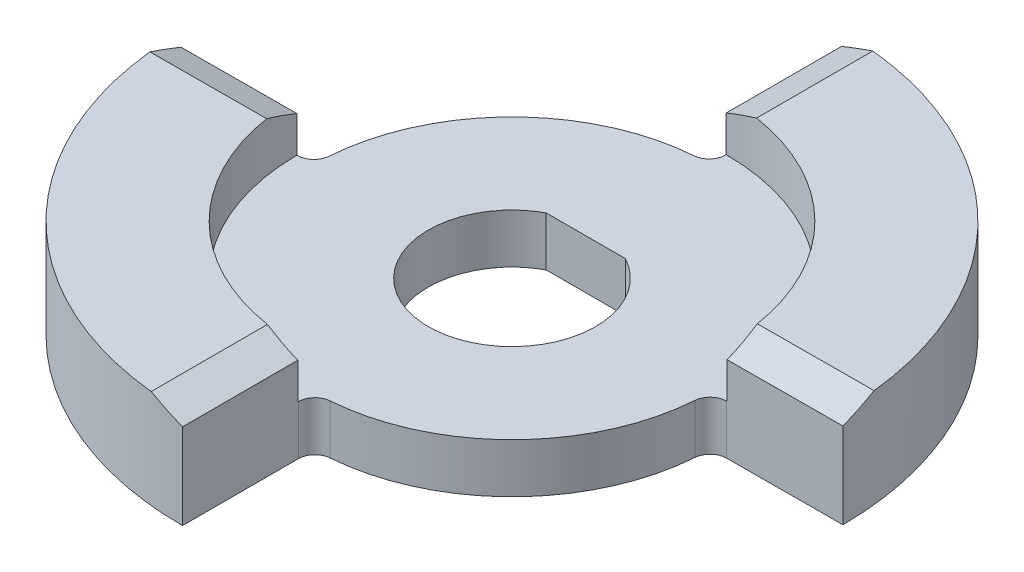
ISO-10303-21;
HEADER;
FILE_DESCRIPTION(('STEP AP214'),'2;1');
FILE_NAME('part.step','',(''),(''),'','','');
FILE_SCHEMA(('AUTOMOTIVE_DESIGN { 1 0 10303 214 1 1 1 1 }'));
ENDSEC;
DATA;
#1=APPLICATION_CONTEXT('core data for automotive mechanical design processes');
#2=APPLICATION_PROTOCOL_DEFINITION('international standard','automotive_design',2000,#1);
#3=PRODUCT_CONTEXT('',#1,'mechanical');
#4=PRODUCT('Part','Part','',(#3));
#5=PRODUCT_RELATED_PRODUCT_CATEGORY('part','',(#4));
#6=PRODUCT_DEFINITION_FORMATION('','',#4);
#7=PRODUCT_DEFINITION_CONTEXT('part definition',#1,'design');
#8=PRODUCT_DEFINITION('design','',#6,#7);
#9=PRODUCT_DEFINITION_SHAPE('','',#8);
#10=(LENGTH_UNIT() NAMED_UNIT(*) SI_UNIT(.MILLI.,.METRE.));
#11=(NAMED_UNIT(*) PLANE_ANGLE_UNIT() SI_UNIT($,.RADIAN.));
#12=(NAMED_UNIT(*) SI_UNIT($,.STERADIAN.) SOLID_ANGLE_UNIT());
#13=UNCERTAINTY_MEASURE_WITH_UNIT(LENGTH_MEASURE(1.E-05),#10,'distance_accuracy_value','');
#14=(GEOMETRIC_REPRESENTATION_CONTEXT(3) GLOBAL_UNCERTAINTY_ASSIGNED_CONTEXT((#13)) GLOBAL_UNIT_ASSIGNED_CONTEXT((#10,
#11,#12)) REPRESENTATION_CONTEXT('',''));
#15=CARTESIAN_POINT('',(0.,0.,0.));
#16=DIRECTION('',(0.,0.,1.));
#17=DIRECTION('',(1.,0.,0.));
#18=AXIS2_PLACEMENT_3D('',#15,#16,#17);
#19=CARTESIAN_POINT('',(0.,0.,0.));
#20=DIRECTION('',(0.,1.,0.));
#21=DIRECTION('',(0.,0.,1.));
#22=AXIS2_PLACEMENT_3D('',#19,#20,#21);
#23=CYLINDRICAL_SURFACE('',#22,19.05);
#24=DIRECTION('',(0.,1.,0.));
#25=VECTOR('',#24,1.);
#26=CARTESIAN_POINT('',(18.9997685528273,0.,1.3824959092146));
#27=LINE('',#26,#25);
#28=CARTESIAN_POINT('',(18.9997685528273,3.175,1.3824959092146));
#29=VERTEX_POINT('',#28);
#30=CARTESIAN_POINT('',(18.9997685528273,7.9375,1.3824959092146));
#31=VERTEX_POINT('',#30);
#32=EDGE_CURVE('E314',#29,#31,#27,.T.);
#33=ORIENTED_EDGE('',*,*,#32,.T.);
#34=CARTESIAN_POINT('',(0.,7.9375,0.));
#35=DIRECTION('',(0.,1.,0.));
#36=DIRECTION('',(0.,0.,1.));
#37=AXIS2_PLACEMENT_3D('',#34,#35,#36);
#38=CIRCLE('',#37,19.05);
#39=CARTESIAN_POINT('',(1.46538461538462,7.9375,18.9935554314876));
#40=VERTEX_POINT('',#39);
#41=EDGE_CURVE('E363',#31,#40,#38,.F.);
#42=ORIENTED_EDGE('',*,*,#41,.T.);
#43=DIRECTION('',(0.,1.,0.));
#44=VECTOR('',#43,1.);
#45=CARTESIAN_POINT('',(1.46538461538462,0.,18.9935554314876));
#46=LINE('',#45,#44);
#47=CARTESIAN_POINT('',(1.46538461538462,3.175,18.9935554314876));
#48=VERTEX_POINT('',#47);
#49=EDGE_CURVE('E317',#40,#48,#46,.F.);
#50=ORIENTED_EDGE('',*,*,#49,.T.);
#51=CARTESIAN_POINT('',(0.,3.175,0.));
#52=DIRECTION('',(0.,-1.,0.));
#53=DIRECTION('',(0.,0.,-1.));
#54=AXIS2_PLACEMENT_3D('',#51,#52,#53);
#55=CIRCLE('',#54,19.05);
#56=EDGE_CURVE('E249',#48,#29,#55,.F.);
#57=ORIENTED_EDGE('',*,*,#56,.T.);
#58=EDGE_LOOP('',(#33,#42,#50,#57));
#59=FACE_BOUND('',#58,.T.);
#60=ADVANCED_FACE('F38',(#59),#23,.T.);
#61=CARTESIAN_POINT('',(0.,0.,0.));
#62=DIRECTION('',(0.,1.,0.));
#63=DIRECTION('',(0.,0.,1.));
#64=AXIS2_PLACEMENT_3D('',#61,#62,#63);
#65=CYLINDRICAL_SURFACE('',#64,19.05);
#66=DIRECTION('',(0.,1.,0.));
#67=VECTOR('',#66,1.);
#68=CARTESIAN_POINT('',(-18.9997685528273,0.,-1.3824959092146));
#69=LINE('',#68,#67);
#70=CARTESIAN_POINT('',(-18.9997685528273,3.175,-1.3824959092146));
#71=VERTEX_POINT('',#70);
#72=CARTESIAN_POINT('',(-18.9997685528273,7.9375,-1.3824959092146));
#73=VERTEX_POINT('',#72);
#74=EDGE_CURVE('E323',#71,#73,#69,.T.);
#75=ORIENTED_EDGE('',*,*,#74,.T.);
#76=CARTESIAN_POINT('',(0.,7.9375,0.));
#77=DIRECTION('',(0.,1.,0.));
#78=DIRECTION('',(0.,0.,1.));
#79=AXIS2_PLACEMENT_3D('',#76,#77,#78);
#80=CIRCLE('',#79,19.05);
#81=CARTESIAN_POINT('',(-1.46538461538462,7.9375,-18.9935554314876));
#82=VERTEX_POINT('',#81);
#83=EDGE_CURVE('E350',#73,#82,#80,.F.);
#84=ORIENTED_EDGE('',*,*,#83,.T.);
#85=DIRECTION('',(0.,1.,0.));
#86=VECTOR('',#85,1.);
#87=CARTESIAN_POINT('',(-1.46538461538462,0.,-18.9935554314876));
#88=LINE('',#87,#86);
#89=CARTESIAN_POINT('',(-1.46538461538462,3.175,-18.9935554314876));
#90=VERTEX_POINT('',#89);
#91=EDGE_CURVE('E321',#82,#90,#88,.F.);
#92=ORIENTED_EDGE('',*,*,#91,.T.);
#93=CARTESIAN_POINT('',(0.,3.175,0.));
#94=DIRECTION('',(0.,-1.,0.));
#95=DIRECTION('',(0.,0.,-1.));
#96=AXIS2_PLACEMENT_3D('',#93,#94,#95);
#97=CIRCLE('',#96,19.05);
#98=EDGE_CURVE('E239',#90,#71,#97,.F.);
#99=ORIENTED_EDGE('',*,*,#98,.T.);
#100=EDGE_LOOP('',(#75,#84,#92,#99));
#101=FACE_BOUND('',#100,.T.);
#102=ADVANCED_FACE('F353',(#101),#65,.T.);
#103=CARTESIAN_POINT('',(0.,0.,0.));
#104=DIRECTION('',(0.,1.,0.));
#105=DIRECTION('',(0.,0.,1.));
#106=AXIS2_PLACEMENT_3D('',#103,#104,#105);
#107=CYLINDRICAL_SURFACE('',#106,8.0645);
#108=CARTESIAN_POINT('',(0.,7.9375,0.));
#109=DIRECTION('',(0.,1.,0.));
#110=DIRECTION('',(0.,0.,1.));
#111=AXIS2_PLACEMENT_3D('',#108,#109,#110);
#112=CIRCLE('',#111,8.0645);
#113=CARTESIAN_POINT('',(3.81,7.9375,-7.1077464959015));
#114=VERTEX_POINT('',#113);
#115=CARTESIAN_POINT('',(-3.81,7.9375,-7.1077464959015));
#116=VERTEX_POINT('',#115);
#117=EDGE_CURVE('E52',#114,#116,#112,.F.);
#118=ORIENTED_EDGE('',*,*,#117,.F.);
#119=DIRECTION('',(0.,1.,0.));
#120=VECTOR('',#119,1.);
#121=CARTESIAN_POINT('',(3.81,0.,-7.1077464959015));
#122=LINE('',#121,#120);
#123=CARTESIAN_POINT('',(3.81,3.175,-7.1077464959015));
#124=VERTEX_POINT('',#123);
#125=EDGE_CURVE('E257',#124,#114,#122,.T.);
#126=ORIENTED_EDGE('',*,*,#125,.F.);
#127=CARTESIAN_POINT('',(0.,3.175,0.));
#128=DIRECTION('',(0.,-1.,0.));
#129=DIRECTION('',(0.,0.,-1.));
#130=AXIS2_PLACEMENT_3D('',#127,#128,#129);
#131=CIRCLE('',#130,8.0645);
#132=CARTESIAN_POINT('',(-3.81,3.175,-7.1077464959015));
#133=VERTEX_POINT('',#132);
#134=EDGE_CURVE('E196',#133,#124,#131,.F.);
#135=ORIENTED_EDGE('',*,*,#134,.F.);
#136=DIRECTION('',(0.,1.,0.));
#137=VECTOR('',#136,1.);
#138=CARTESIAN_POINT('',(-3.81,0.,-7.1077464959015));
#139=LINE('',#138,#137);
#140=EDGE_CURVE('E258',#133,#116,#139,.T.);
#141=ORIENTED_EDGE('',*,*,#140,.T.);
#142=EDGE_LOOP('',(#118,#126,#135,#141));
#143=FACE_BOUND('',#142,.T.);
#144=ADVANCED_FACE('F418',(#143),#107,.F.);
#145=CARTESIAN_POINT('',(-3.81,0.,-7.1077464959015));
#146=DIRECTION('',(0.,0.,-1.));
#147=DIRECTION('',(-1.,0.,0.));
#148=AXIS2_PLACEMENT_3D('',#145,#146,#147);
#149=PLANE('',#148);
#150=DIRECTION('',(1.,0.,0.));
#151=VECTOR('',#150,1.);
#152=CARTESIAN_POINT('',(-3.81,7.9375,-7.1077464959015));
#153=LINE('',#152,#151);
#154=EDGE_CURVE('E211',#116,#114,#153,.T.);
#155=ORIENTED_EDGE('',*,*,#154,.F.);
#156=ORIENTED_EDGE('',*,*,#140,.F.);
#157=DIRECTION('',(-1.,0.,0.));
#158=VECTOR('',#157,1.);
#159=CARTESIAN_POINT('',(-3.81,3.175,-7.1077464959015));
#160=LINE('',#159,#158);
#161=EDGE_CURVE('E308',#124,#133,#160,.T.);
#162=ORIENTED_EDGE('',*,*,#161,.F.);
#163=ORIENTED_EDGE('',*,*,#125,.T.);
#164=EDGE_LOOP('',(#155,#156,#162,#163));
#165=FACE_BOUND('',#164,.T.);
#166=ADVANCED_FACE('F455',(#165),#149,.F.);
#167=CARTESIAN_POINT('',(1.5875,0.,20.576351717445));
#168=DIRECTION('',(0.,1.,0.));
#169=DIRECTION('',(0.,0.,1.));
#170=AXIS2_PLACEMENT_3D('',#167,#168,#169);
#171=CYLINDRICAL_SURFACE('',#170,1.5875);
#172=CARTESIAN_POINT('',(1.5875,7.9375,20.576351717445));
#173=DIRECTION('',(0.,1.,0.));
#174=DIRECTION('',(0.,0.,1.));
#175=AXIS2_PLACEMENT_3D('',#172,#173,#174);
#176=CIRCLE('',#175,1.5875);
#177=CARTESIAN_POINT('',(0.,7.9375,20.576351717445));
#178=VERTEX_POINT('',#177);
#179=EDGE_CURVE('E212',#178,#40,#176,.F.);
#180=ORIENTED_EDGE('',*,*,#179,.F.);
#181=DIRECTION('',(0.,1.,0.));
#182=VECTOR('',#181,1.);
#183=CARTESIAN_POINT('',(0.,0.,20.576351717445));
#184=LINE('',#183,#182);
#185=CARTESIAN_POINT('',(0.,3.175,20.576351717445));
#186=VERTEX_POINT('',#185);
#187=EDGE_CURVE('E210',#186,#178,#184,.T.);
#188=ORIENTED_EDGE('',*,*,#187,.F.);
#189=CARTESIAN_POINT('',(1.5875,3.175,20.576351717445));
#190=DIRECTION('',(0.,-1.,0.));
#191=DIRECTION('',(0.,0.,-1.));
#192=AXIS2_PLACEMENT_3D('',#189,#190,#191);
#193=CIRCLE('',#192,1.5875);
#194=EDGE_CURVE('E331',#48,#186,#193,.F.);
#195=ORIENTED_EDGE('',*,*,#194,.F.);
#196=ORIENTED_EDGE('',*,*,#49,.F.);
#197=EDGE_LOOP('',(#180,#188,#195,#196));
#198=FACE_BOUND('',#197,.T.);
#199=ADVANCED_FACE('F381',(#198),#171,.F.);
#200=CARTESIAN_POINT('',(20.5830825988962,0.,1.49770390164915));
#201=DIRECTION('',(0.,1.,0.));
#202=DIRECTION('',(0.,0.,1.));
#203=AXIS2_PLACEMENT_3D('',#200,#201,#202);
#204=CYLINDRICAL_SURFACE('',#203,1.5875);
#205=CARTESIAN_POINT('',(20.5830825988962,7.9375,1.49770390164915));
#206=DIRECTION('',(0.,1.,0.));
#207=DIRECTION('',(0.,0.,1.));
#208=AXIS2_PLACEMENT_3D('',#205,#206,#207);
#209=CIRCLE('',#208,1.5875);
#210=CARTESIAN_POINT('',(20.5761558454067,7.9375,-0.0897809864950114));
#211=VERTEX_POINT('',#210);
#212=EDGE_CURVE('E361',#31,#211,#209,.F.);
#213=ORIENTED_EDGE('',*,*,#212,.F.);
#214=ORIENTED_EDGE('',*,*,#32,.F.);
#215=CARTESIAN_POINT('',(20.5830825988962,3.175,1.49770390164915));
#216=DIRECTION('',(0.,-1.,0.));
#217=DIRECTION('',(0.,0.,-1.));
#218=AXIS2_PLACEMENT_3D('',#215,#216,#217);
#219=CIRCLE('',#218,1.5875);
#220=CARTESIAN_POINT('',(20.5761558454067,3.175,-0.0897809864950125));
#221=VERTEX_POINT('',#220);
#222=EDGE_CURVE('E333',#221,#29,#219,.F.);
#223=ORIENTED_EDGE('',*,*,#222,.F.);
#224=DIRECTION('',(0.,-1.,0.));
#225=VECTOR('',#224,1.);
#226=CARTESIAN_POINT('',(20.5761558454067,3.175,-0.0897809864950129));
#227=LINE('',#226,#225);
#228=EDGE_CURVE('E319',#211,#221,#227,.T.);
#229=ORIENTED_EDGE('',*,*,#228,.F.);
#230=EDGE_LOOP('',(#213,#214,#223,#229));
#231=FACE_BOUND('',#230,.T.);
#232=ADVANCED_FACE('F375',(#231),#204,.F.);
#233=CARTESIAN_POINT('',(-20.5830825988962,0.,-1.49770390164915));
#234=DIRECTION('',(0.,1.,0.));
#235=DIRECTION('',(0.,0.,1.));
#236=AXIS2_PLACEMENT_3D('',#233,#234,#235);
#237=CYLINDRICAL_SURFACE('',#236,1.5875);
#238=CARTESIAN_POINT('',(-20.5830825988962,7.9375,-1.49770390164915));
#239=DIRECTION('',(0.,1.,0.));
#240=DIRECTION('',(0.,0.,1.));
#241=AXIS2_PLACEMENT_3D('',#238,#239,#240);
#242=CIRCLE('',#241,1.5875);
#243=CARTESIAN_POINT('',(-20.5761558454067,7.9375,0.0897809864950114));
#244=VERTEX_POINT('',#243);
#245=EDGE_CURVE('E356',#73,#244,#242,.F.);
#246=ORIENTED_EDGE('',*,*,#245,.F.);
#247=ORIENTED_EDGE('',*,*,#74,.F.);
#248=CARTESIAN_POINT('',(-20.5830825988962,3.175,-1.49770390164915));
#249=DIRECTION('',(0.,-1.,0.));
#250=DIRECTION('',(0.,0.,-1.));
#251=AXIS2_PLACEMENT_3D('',#248,#249,#250);
#252=CIRCLE('',#251,1.5875);
#253=CARTESIAN_POINT('',(-20.5761558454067,3.175,0.0897809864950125));
#254=VERTEX_POINT('',#253);
#255=EDGE_CURVE('E335',#254,#71,#252,.F.);
#256=ORIENTED_EDGE('',*,*,#255,.F.);
#257=DIRECTION('',(0.,-1.,0.));
#258=VECTOR('',#257,1.);
#259=CARTESIAN_POINT('',(-20.5761558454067,3.175,0.0897809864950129));
#260=LINE('',#259,#258);
#261=EDGE_CURVE('E326',#244,#254,#260,.T.);
#262=ORIENTED_EDGE('',*,*,#261,.F.);
#263=EDGE_LOOP('',(#246,#247,#256,#262));
#264=FACE_BOUND('',#263,.T.);
#265=ADVANCED_FACE('F406',(#264),#237,.F.);
#266=CARTESIAN_POINT('',(-1.5875,0.,-20.576351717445));
#267=DIRECTION('',(0.,1.,0.));
#268=DIRECTION('',(0.,0.,1.));
#269=AXIS2_PLACEMENT_3D('',#266,#267,#268);
#270=CYLINDRICAL_SURFACE('',#269,1.5875);
#271=CARTESIAN_POINT('',(-1.5875,7.9375,-20.576351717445));
#272=DIRECTION('',(0.,1.,0.));
#273=DIRECTION('',(0.,0.,1.));
#274=AXIS2_PLACEMENT_3D('',#271,#272,#273);
#275=CIRCLE('',#274,1.5875);
#276=CARTESIAN_POINT('',(0.,7.9375,-20.576351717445));
#277=VERTEX_POINT('',#276);
#278=EDGE_CURVE('E11',#277,#82,#275,.F.);
#279=ORIENTED_EDGE('',*,*,#278,.F.);
#280=DIRECTION('',(0.,1.,0.));
#281=VECTOR('',#280,1.);
#282=CARTESIAN_POINT('',(0.,0.,-20.576351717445));
#283=LINE('',#282,#281);
#284=CARTESIAN_POINT('',(0.,3.175,-20.576351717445));
#285=VERTEX_POINT('',#284);
#286=EDGE_CURVE('E328',#285,#277,#283,.T.);
#287=ORIENTED_EDGE('',*,*,#286,.F.);
#288=CARTESIAN_POINT('',(-1.5875,3.175,-20.576351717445));
#289=DIRECTION('',(0.,-1.,0.));
#290=DIRECTION('',(0.,0.,-1.));
#291=AXIS2_PLACEMENT_3D('',#288,#289,#290);
#292=CIRCLE('',#291,1.5875);
#293=EDGE_CURVE('E46',#90,#285,#292,.F.);
#294=ORIENTED_EDGE('',*,*,#293,.F.);
#295=ORIENTED_EDGE('',*,*,#91,.F.);
#296=EDGE_LOOP('',(#279,#287,#294,#295));
#297=FACE_BOUND('',#296,.T.);
#298=ADVANCED_FACE('F40',(#297),#270,.F.);
#299=CARTESIAN_POINT('',(19.04981865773,0.,-0.0831210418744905));
#300=DIRECTION('',(0.00436330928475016,0.,0.999990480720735));
#301=DIRECTION('',(0.999990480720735,0.,-0.00436330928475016));
#302=AXIS2_PLACEMENT_3D('',#299,#300,#301);
#303=PLANE('',#302);
#304=DIRECTION('',(0.,-1.,0.));
#305=VECTOR('',#304,1.);
#306=CARTESIAN_POINT('',(20.6373035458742,71.0716647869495,-0.0900477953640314));
#307=LINE('',#306,#305);
#308=CARTESIAN_POINT('',(20.6373035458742,11.4172167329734,-0.0900477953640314));
#309=VERTEX_POINT('',#308);
#310=CARTESIAN_POINT('',(20.6373035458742,7.9375,-0.0900477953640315));
#311=VERTEX_POINT('',#310);
#312=EDGE_CURVE('E233',#309,#311,#307,.T.);
#313=ORIENTED_EDGE('',*,*,#312,.T.);
#314=DIRECTION('',(-0.999990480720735,0.,0.00436330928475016));
#315=VECTOR('',#314,1.);
#316=CARTESIAN_POINT('',(19.04981865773,7.9375,-0.0831210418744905));
#317=LINE('',#316,#315);
#318=EDGE_CURVE('E215',#311,#211,#317,.T.);
#319=ORIENTED_EDGE('',*,*,#318,.T.);
#320=ORIENTED_EDGE('',*,*,#228,.T.);
#321=DIRECTION('',(0.999990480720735,0.,-0.00436330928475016));
#322=VECTOR('',#321,1.);
#323=CARTESIAN_POINT('',(19.04981865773,3.175,-0.0831210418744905));
#324=LINE('',#323,#322);
#325=CARTESIAN_POINT('',(31.7496977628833,3.175,-0.138535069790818));
#326=VERTEX_POINT('',#325);
#327=EDGE_CURVE('E247',#221,#326,#324,.T.);
#328=ORIENTED_EDGE('',*,*,#327,.T.);
#329=DIRECTION('',(0.,1.,0.));
#330=VECTOR('',#329,1.);
#331=CARTESIAN_POINT('',(31.7496977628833,0.,-0.138535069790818));
#332=LINE('',#331,#330);
#333=CARTESIAN_POINT('',(31.7496977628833,11.4172167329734,-0.138535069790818));
#334=VERTEX_POINT('',#333);
#335=EDGE_CURVE('E271',#326,#334,#332,.T.);
#336=ORIENTED_EDGE('',*,*,#335,.T.);
#337=DIRECTION('',(-0.999990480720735,0.,0.00436330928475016));
#338=VECTOR('',#337,1.);
#339=CARTESIAN_POINT('',(19.04981865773,11.4172167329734,-0.0831210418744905));
#340=LINE('',#339,#338);
#341=EDGE_CURVE('E290',#334,#309,#340,.T.);
#342=ORIENTED_EDGE('',*,*,#341,.T.);
#343=EDGE_LOOP('',(#313,#319,#320,#328,#336,#342));
#344=FACE_BOUND('',#343,.T.);
#345=ADVANCED_FACE('F369',(#344),#303,.T.);
#346=CARTESIAN_POINT('',(0.,0.,19.05));
#347=DIRECTION('',(-1.,0.,0.));
#348=DIRECTION('',(0.,0.,1.));
#349=AXIS2_PLACEMENT_3D('',#346,#347,#348);
#350=PLANE('',#349);
#351=DIRECTION('',(0.,0.,-1.));
#352=VECTOR('',#351,1.);
#353=CARTESIAN_POINT('',(0.,7.9375,19.05));
#354=LINE('',#353,#352);
#355=CARTESIAN_POINT('',(0.,7.9375,20.6375));
#356=VERTEX_POINT('',#355);
#357=EDGE_CURVE('E200',#356,#178,#354,.T.);
#358=ORIENTED_EDGE('',*,*,#357,.F.);
#359=DIRECTION('',(0.,-1.,0.));
#360=VECTOR('',#359,1.);
#361=CARTESIAN_POINT('',(0.,71.0716647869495,20.6375));
#362=LINE('',#361,#360);
#363=CARTESIAN_POINT('',(0.,11.4172167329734,20.6375));
#364=VERTEX_POINT('',#363);
#365=EDGE_CURVE('E187',#364,#356,#362,.T.);
#366=ORIENTED_EDGE('',*,*,#365,.F.);
#367=DIRECTION('',(0.,0.,1.));
#368=VECTOR('',#367,1.);
#369=CARTESIAN_POINT('',(0.,11.4172167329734,31.75));
#370=LINE('',#369,#368);
#371=CARTESIAN_POINT('',(0.,11.4172167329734,31.75));
#372=VERTEX_POINT('',#371);
#373=EDGE_CURVE('E277',#364,#372,#370,.T.);
#374=ORIENTED_EDGE('',*,*,#373,.T.);
#375=DIRECTION('',(0.,1.,0.));
#376=VECTOR('',#375,1.);
#377=CARTESIAN_POINT('',(0.,0.,31.75));
#378=LINE('',#377,#376);
#379=CARTESIAN_POINT('',(0.,3.175,31.75));
#380=VERTEX_POINT('',#379);
#381=EDGE_CURVE('E268',#380,#372,#378,.T.);
#382=ORIENTED_EDGE('',*,*,#381,.F.);
#383=DIRECTION('',(0.,0.,1.));
#384=VECTOR('',#383,1.);
#385=CARTESIAN_POINT('',(0.,3.175,19.05));
#386=LINE('',#385,#384);
#387=EDGE_CURVE('E255',#186,#380,#386,.T.);
#388=ORIENTED_EDGE('',*,*,#387,.F.);
#389=ORIENTED_EDGE('',*,*,#187,.T.);
#390=EDGE_LOOP('',(#358,#366,#374,#382,#388,#389));
#391=FACE_BOUND('',#390,.T.);
#392=ADVANCED_FACE('F207',(#391),#350,.F.);
#393=CARTESIAN_POINT('',(-19.04981865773,0.,0.0831210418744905));
#394=DIRECTION('',(-0.00436330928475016,0.,-0.999990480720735));
#395=DIRECTION('',(-0.999990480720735,0.,0.00436330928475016));
#396=AXIS2_PLACEMENT_3D('',#393,#394,#395);
#397=PLANE('',#396);
#398=DIRECTION('',(0.,-1.,0.));
#399=VECTOR('',#398,1.);
#400=CARTESIAN_POINT('',(-20.6373035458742,71.0716647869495,0.0900477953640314));
#401=LINE('',#400,#399);
#402=CARTESIAN_POINT('',(-20.6373035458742,11.4172167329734,0.0900477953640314));
#403=VERTEX_POINT('',#402);
#404=CARTESIAN_POINT('',(-20.6373035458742,7.9375,0.0900477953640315));
#405=VERTEX_POINT('',#404);
#406=EDGE_CURVE('E223',#403,#405,#401,.T.);
#407=ORIENTED_EDGE('',*,*,#406,.T.);
#408=DIRECTION('',(0.999990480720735,0.,-0.00436330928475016));
#409=VECTOR('',#408,1.);
#410=CARTESIAN_POINT('',(-19.04981865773,7.9375,0.0831210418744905));
#411=LINE('',#410,#409);
#412=EDGE_CURVE('E203',#405,#244,#411,.T.);
#413=ORIENTED_EDGE('',*,*,#412,.T.);
#414=ORIENTED_EDGE('',*,*,#261,.T.);
#415=DIRECTION('',(-0.999990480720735,0.,0.00436330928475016));
#416=VECTOR('',#415,1.);
#417=CARTESIAN_POINT('',(-19.04981865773,3.175,0.0831210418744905));
#418=LINE('',#417,#416);
#419=CARTESIAN_POINT('',(-31.7496977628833,3.175,0.138535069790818));
#420=VERTEX_POINT('',#419);
#421=EDGE_CURVE('E245',#254,#420,#418,.T.);
#422=ORIENTED_EDGE('',*,*,#421,.T.);
#423=DIRECTION('',(0.,1.,0.));
#424=VECTOR('',#423,1.);
#425=CARTESIAN_POINT('',(-31.7496977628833,0.,0.138535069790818));
#426=LINE('',#425,#424);
#427=CARTESIAN_POINT('',(-31.7496977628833,11.4172167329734,0.138535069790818));
#428=VERTEX_POINT('',#427);
#429=EDGE_CURVE('E266',#420,#428,#426,.T.);
#430=ORIENTED_EDGE('',*,*,#429,.T.);
#431=DIRECTION('',(0.999990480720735,0.,-0.00436330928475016));
#432=VECTOR('',#431,1.);
#433=CARTESIAN_POINT('',(-19.04981865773,11.4172167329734,0.0831210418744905));
#434=LINE('',#433,#432);
#435=EDGE_CURVE('E305',#428,#403,#434,.T.);
#436=ORIENTED_EDGE('',*,*,#435,.T.);
#437=EDGE_LOOP('',(#407,#413,#414,#422,#430,#436));
#438=FACE_BOUND('',#437,.T.);
#439=ADVANCED_FACE('F401',(#438),#397,.T.);
#440=CARTESIAN_POINT('',(0.,0.,-19.05));
#441=DIRECTION('',(1.,0.,0.));
#442=DIRECTION('',(0.,0.,-1.));
#443=AXIS2_PLACEMENT_3D('',#440,#441,#442);
#444=PLANE('',#443);
#445=DIRECTION('',(0.,0.,1.));
#446=VECTOR('',#445,1.);
#447=CARTESIAN_POINT('',(0.,7.9375,-19.05));
#448=LINE('',#447,#446);
#449=CARTESIAN_POINT('',(0.,7.9375,-20.6375));
#450=VERTEX_POINT('',#449);
#451=EDGE_CURVE('E59',#450,#277,#448,.T.);
#452=ORIENTED_EDGE('',*,*,#451,.F.);
#453=DIRECTION('',(0.,-1.,0.));
#454=VECTOR('',#453,1.);
#455=CARTESIAN_POINT('',(0.,71.0716647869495,-20.6375));
#456=LINE('',#455,#454);
#457=CARTESIAN_POINT('',(0.,11.4172167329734,-20.6375));
#458=VERTEX_POINT('',#457);
#459=EDGE_CURVE('E228',#458,#450,#456,.T.);
#460=ORIENTED_EDGE('',*,*,#459,.F.);
#461=DIRECTION('',(0.,0.,-1.));
#462=VECTOR('',#461,1.);
#463=CARTESIAN_POINT('',(0.,11.4172167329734,-31.75));
#464=LINE('',#463,#462);
#465=CARTESIAN_POINT('',(0.,11.4172167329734,-31.75));
#466=VERTEX_POINT('',#465);
#467=EDGE_CURVE('E293',#458,#466,#464,.T.);
#468=ORIENTED_EDGE('',*,*,#467,.T.);
#469=DIRECTION('',(0.,1.,0.));
#470=VECTOR('',#469,1.);
#471=CARTESIAN_POINT('',(0.,0.,-31.75));
#472=LINE('',#471,#470);
#473=CARTESIAN_POINT('',(0.,3.175,-31.75));
#474=VERTEX_POINT('',#473);
#475=EDGE_CURVE('E261',#474,#466,#472,.T.);
#476=ORIENTED_EDGE('',*,*,#475,.F.);
#477=DIRECTION('',(0.,0.,-1.));
#478=VECTOR('',#477,1.);
#479=CARTESIAN_POINT('',(0.,3.175,-19.05));
#480=LINE('',#479,#478);
#481=EDGE_CURVE('E237',#285,#474,#480,.T.);
#482=ORIENTED_EDGE('',*,*,#481,.F.);
#483=ORIENTED_EDGE('',*,*,#286,.T.);
#484=EDGE_LOOP('',(#452,#460,#468,#476,#482,#483));
#485=FACE_BOUND('',#484,.T.);
#486=ADVANCED_FACE('F348',(#485),#444,.F.);
#487=CARTESIAN_POINT('',(0.,11.4172167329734,19.05));
#488=DIRECTION('',(0.374606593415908,0.927183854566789,0.));
#489=DIRECTION('',(0.,0.,-1.));
#490=AXIS2_PLACEMENT_3D('',#487,#488,#489);
#491=PLANE('',#490);
#492=ORIENTED_EDGE('',*,*,#373,.F.);
#493=CARTESIAN_POINT('',(0.,11.4172167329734,0.));
#494=DIRECTION('',(0.374606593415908,0.927183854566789,0.));
#495=DIRECTION('',(0.927183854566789,-0.374606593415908,0.));
#496=AXIS2_PLACEMENT_3D('',#493,#494,#495);
#497=ELLIPSE('',#496,22.2582607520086,20.6375);
#498=CARTESIAN_POINT('',(-3.17500000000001,12.7,20.3918067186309));
#499=VERTEX_POINT('',#498);
#500=EDGE_CURVE('E192',#364,#499,#497,.F.);
#501=ORIENTED_EDGE('',*,*,#500,.T.);
#502=DIRECTION('',(0.,0.,-1.));
#503=VECTOR('',#502,1.);
#504=CARTESIAN_POINT('',(-3.17500000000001,12.7,19.05));
#505=LINE('',#504,#503);
#506=CARTESIAN_POINT('',(-3.17500000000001,12.7,31.5908511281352));
#507=VERTEX_POINT('',#506);
#508=EDGE_CURVE('E282',#507,#499,#505,.T.);
#509=ORIENTED_EDGE('',*,*,#508,.F.);
#510=CARTESIAN_POINT('',(0.,11.4172167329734,0.));
#511=DIRECTION('',(0.374606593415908,0.927183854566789,0.));
#512=DIRECTION('',(0.927183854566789,-0.374606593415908,0.));
#513=AXIS2_PLACEMENT_3D('',#510,#511,#512);
#514=ELLIPSE('',#513,34.2434780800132,31.75);
#515=EDGE_CURVE('E279',#372,#507,#514,.F.);
#516=ORIENTED_EDGE('',*,*,#515,.F.);
#517=EDGE_LOOP('',(#492,#501,#509,#516));
#518=FACE_BOUND('',#517,.T.);
#519=ADVANCED_FACE('F391',(#518),#491,.T.);
#520=CARTESIAN_POINT('',(-0.0138535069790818,12.7,-3.17496977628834));
#521=DIRECTION('',(-0.00163452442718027,-0.927183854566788,-0.374603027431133));
#522=DIRECTION('',(0.999990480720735,0.,-0.00436330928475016));
#523=AXIS2_PLACEMENT_3D('',#520,#521,#522);
#524=PLANE('',#523);
#525=DIRECTION('',(0.999990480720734,0.,-0.00436330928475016));
#526=VECTOR('',#525,1.);
#527=CARTESIAN_POINT('',(-0.0138535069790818,12.7,-3.17496977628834));
#528=LINE('',#527,#526);
#529=CARTESIAN_POINT('',(20.3777590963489,12.7,-3.26394553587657));
#530=VERTEX_POINT('',#529);
#531=CARTESIAN_POINT('',(31.576696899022,12.7,-3.31281043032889));
#532=VERTEX_POINT('',#531);
#533=EDGE_CURVE('E285',#530,#532,#528,.T.);
#534=ORIENTED_EDGE('',*,*,#533,.F.);
#535=CARTESIAN_POINT('',(0.,11.4172167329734,0.));
#536=DIRECTION('',(-0.00163452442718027,-0.927183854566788,-0.374603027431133));
#537=DIRECTION('',(0.00404558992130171,-0.37460659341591,0.927175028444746));
#538=AXIS2_PLACEMENT_3D('',#535,#536,#537);
#539=ELLIPSE('',#538,22.2582607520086,20.6375);
#540=EDGE_CURVE('E230',#530,#309,#539,.T.);
#541=ORIENTED_EDGE('',*,*,#540,.T.);
#542=ORIENTED_EDGE('',*,*,#341,.F.);
#543=CARTESIAN_POINT('',(0.,11.4172167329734,0.));
#544=DIRECTION('',(-0.00163452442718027,-0.927183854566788,-0.374603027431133));
#545=DIRECTION('',(0.00404558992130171,-0.37460659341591,0.927175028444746));
#546=AXIS2_PLACEMENT_3D('',#543,#544,#545);
#547=ELLIPSE('',#546,34.2434780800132,31.75);
#548=EDGE_CURVE('E287',#532,#334,#547,.T.);
#549=ORIENTED_EDGE('',*,*,#548,.F.);
#550=EDGE_LOOP('',(#534,#541,#542,#549));
#551=FACE_BOUND('',#550,.T.);
#552=ADVANCED_FACE('F436',(#551),#524,.F.);
#553=CARTESIAN_POINT('',(0.,11.4172167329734,-19.05));
#554=DIRECTION('',(-0.374606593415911,0.927183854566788,0.));
#555=DIRECTION('',(0.,0.,1.));
#556=AXIS2_PLACEMENT_3D('',#553,#554,#555);
#557=PLANE('',#556);
#558=ORIENTED_EDGE('',*,*,#467,.F.);
#559=CARTESIAN_POINT('',(0.,11.4172167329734,0.));
#560=DIRECTION('',(-0.374606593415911,0.927183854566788,0.));
#561=DIRECTION('',(-0.927183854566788,-0.374606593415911,0.));
#562=AXIS2_PLACEMENT_3D('',#559,#560,#561);
#563=ELLIPSE('',#562,22.2582607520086,20.6375);
#564=CARTESIAN_POINT('',(3.17499999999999,12.7,-20.3918067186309));
#565=VERTEX_POINT('',#564);
#566=EDGE_CURVE('E225',#458,#565,#563,.F.);
#567=ORIENTED_EDGE('',*,*,#566,.T.);
#568=DIRECTION('',(0.,0.,1.));
#569=VECTOR('',#568,1.);
#570=CARTESIAN_POINT('',(3.17499999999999,12.7,-19.05));
#571=LINE('',#570,#569);
#572=CARTESIAN_POINT('',(3.175,12.7,-31.5908511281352));
#573=VERTEX_POINT('',#572);
#574=EDGE_CURVE('E297',#573,#565,#571,.T.);
#575=ORIENTED_EDGE('',*,*,#574,.F.);
#576=CARTESIAN_POINT('',(0.,11.4172167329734,0.));
#577=DIRECTION('',(-0.374606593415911,0.927183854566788,0.));
#578=DIRECTION('',(-0.927183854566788,-0.374606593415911,0.));
#579=AXIS2_PLACEMENT_3D('',#576,#577,#578);
#580=ELLIPSE('',#579,34.2434780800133,31.75);
#581=EDGE_CURVE('E295',#466,#573,#580,.F.);
#582=ORIENTED_EDGE('',*,*,#581,.F.);
#583=EDGE_LOOP('',(#558,#567,#575,#582));
#584=FACE_BOUND('',#583,.T.);
#585=ADVANCED_FACE('F442',(#584),#557,.T.);
#586=CARTESIAN_POINT('',(0.0138535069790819,12.7,3.17496977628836));
#587=DIRECTION('',(0.00163452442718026,-0.927183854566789,0.374603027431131));
#588=DIRECTION('',(-0.999990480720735,0.,0.00436330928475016));
#589=AXIS2_PLACEMENT_3D('',#586,#587,#588);
#590=PLANE('',#589);
#591=DIRECTION('',(-0.999990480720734,0.,0.00436330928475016));
#592=VECTOR('',#591,1.);
#593=CARTESIAN_POINT('',(0.0138535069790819,12.7,3.17496977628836));
#594=LINE('',#593,#592);
#595=CARTESIAN_POINT('',(-20.3777590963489,12.7,3.26394553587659));
#596=VERTEX_POINT('',#595);
#597=CARTESIAN_POINT('',(-31.576696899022,12.7,3.31281043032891));
#598=VERTEX_POINT('',#597);
#599=EDGE_CURVE('E300',#596,#598,#594,.T.);
#600=ORIENTED_EDGE('',*,*,#599,.F.);
#601=CARTESIAN_POINT('',(0.,11.4172167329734,0.));
#602=DIRECTION('',(0.00163452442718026,-0.927183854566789,0.374603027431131));
#603=DIRECTION('',(-0.00404558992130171,-0.374606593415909,-0.927175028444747));
#604=AXIS2_PLACEMENT_3D('',#601,#602,#603);
#605=ELLIPSE('',#604,22.2582607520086,20.6375);
#606=EDGE_CURVE('E310',#596,#403,#605,.T.);
#607=ORIENTED_EDGE('',*,*,#606,.T.);
#608=ORIENTED_EDGE('',*,*,#435,.F.);
#609=CARTESIAN_POINT('',(0.,11.4172167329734,0.));
#610=DIRECTION('',(0.00163452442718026,-0.927183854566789,0.374603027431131));
#611=DIRECTION('',(-0.00404558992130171,-0.374606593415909,-0.927175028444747));
#612=AXIS2_PLACEMENT_3D('',#609,#610,#611);
#613=ELLIPSE('',#612,34.2434780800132,31.75);
#614=EDGE_CURVE('E302',#598,#428,#613,.T.);
#615=ORIENTED_EDGE('',*,*,#614,.F.);
#616=EDGE_LOOP('',(#600,#607,#608,#615));
#617=FACE_BOUND('',#616,.T.);
#618=ADVANCED_FACE('F399',(#617),#590,.F.);
#619=CARTESIAN_POINT('',(0.,12.7,0.));
#620=DIRECTION('',(0.,-1.,0.));
#621=DIRECTION('',(0.,0.,-1.));
#622=AXIS2_PLACEMENT_3D('',#619,#620,#621);
#623=CYLINDRICAL_SURFACE('',#622,31.75);
#624=CARTESIAN_POINT('',(0.,3.175,0.));
#625=DIRECTION('',(0.,-1.,0.));
#626=DIRECTION('',(0.,0.,-1.));
#627=AXIS2_PLACEMENT_3D('',#624,#625,#626);
#628=CIRCLE('',#627,31.75);
#629=EDGE_CURVE('E252',#380,#420,#628,.T.);
#630=ORIENTED_EDGE('',*,*,#629,.F.);
#631=ORIENTED_EDGE('',*,*,#381,.T.);
#632=ORIENTED_EDGE('',*,*,#515,.T.);
#633=CARTESIAN_POINT('',(0.,12.7,0.));
#634=DIRECTION('',(0.,1.,0.));
#635=DIRECTION('',(0.,0.,1.));
#636=AXIS2_PLACEMENT_3D('',#633,#634,#635);
#637=CIRCLE('',#636,31.75);
#638=EDGE_CURVE('E273',#598,#507,#637,.T.);
#639=ORIENTED_EDGE('',*,*,#638,.F.);
#640=ORIENTED_EDGE('',*,*,#614,.T.);
#641=ORIENTED_EDGE('',*,*,#429,.F.);
#642=EDGE_LOOP('',(#630,#631,#632,#639,#640,#641));
#643=FACE_BOUND('',#642,.T.);
#644=ADVANCED_FACE('F386',(#643),#623,.T.);
#645=CARTESIAN_POINT('',(0.,3.175,0.));
#646=DIRECTION('',(0.,-1.,0.));
#647=DIRECTION('',(0.,0.,-1.));
#648=AXIS2_PLACEMENT_3D('',#645,#646,#647);
#649=CIRCLE('',#648,31.75);
#650=EDGE_CURVE('E242',#474,#326,#649,.T.);
#651=ORIENTED_EDGE('',*,*,#650,.F.);
#652=ORIENTED_EDGE('',*,*,#475,.T.);
#653=ORIENTED_EDGE('',*,*,#581,.T.);
#654=EDGE_CURVE('E274',#532,#573,#637,.T.);
#655=ORIENTED_EDGE('',*,*,#654,.F.);
#656=ORIENTED_EDGE('',*,*,#548,.T.);
#657=ORIENTED_EDGE('',*,*,#335,.F.);
#658=EDGE_LOOP('',(#651,#652,#653,#655,#656,#657));
#659=FACE_BOUND('',#658,.T.);
#660=ADVANCED_FACE('F429',(#659),#623,.T.);
#661=CARTESIAN_POINT('',(0.,12.7,0.));
#662=DIRECTION('',(0.,1.,0.));
#663=DIRECTION('',(0.,0.,1.));
#664=AXIS2_PLACEMENT_3D('',#661,#662,#663);
#665=PLANE('',#664);
#666=ORIENTED_EDGE('',*,*,#508,.T.);
#667=CARTESIAN_POINT('',(0.,12.7,0.));
#668=DIRECTION('',(0.,1.,0.));
#669=DIRECTION('',(0.,0.,1.));
#670=AXIS2_PLACEMENT_3D('',#667,#668,#669);
#671=CIRCLE('',#670,20.6375);
#672=EDGE_CURVE('E220',#596,#499,#671,.T.);
#673=ORIENTED_EDGE('',*,*,#672,.F.);
#674=ORIENTED_EDGE('',*,*,#599,.T.);
#675=ORIENTED_EDGE('',*,*,#638,.T.);
#676=EDGE_LOOP('',(#666,#673,#674,#675));
#677=FACE_BOUND('',#676,.T.);
#678=ADVANCED_FACE('F394',(#677),#665,.T.);
#679=ORIENTED_EDGE('',*,*,#574,.T.);
#680=EDGE_CURVE('E221',#530,#565,#671,.T.);
#681=ORIENTED_EDGE('',*,*,#680,.F.);
#682=ORIENTED_EDGE('',*,*,#533,.T.);
#683=ORIENTED_EDGE('',*,*,#654,.T.);
#684=EDGE_LOOP('',(#679,#681,#682,#683));
#685=FACE_BOUND('',#684,.T.);
#686=ADVANCED_FACE('F423',(#685),#665,.T.);
#687=CARTESIAN_POINT('',(0.,3.175,0.));
#688=DIRECTION('',(0.,-1.,0.));
#689=DIRECTION('',(0.,0.,-1.));
#690=AXIS2_PLACEMENT_3D('',#687,#688,#689);
#691=PLANE('',#690);
#692=ORIENTED_EDGE('',*,*,#134,.T.);
#693=ORIENTED_EDGE('',*,*,#161,.T.);
#694=EDGE_LOOP('',(#692,#693));
#695=FACE_BOUND('',#694,.T.);
#696=ORIENTED_EDGE('',*,*,#56,.F.);
#697=ORIENTED_EDGE('',*,*,#194,.T.);
#698=ORIENTED_EDGE('',*,*,#387,.T.);
#699=ORIENTED_EDGE('',*,*,#629,.T.);
#700=ORIENTED_EDGE('',*,*,#421,.F.);
#701=ORIENTED_EDGE('',*,*,#255,.T.);
#702=ORIENTED_EDGE('',*,*,#98,.F.);
#703=ORIENTED_EDGE('',*,*,#293,.T.);
#704=ORIENTED_EDGE('',*,*,#481,.T.);
#705=ORIENTED_EDGE('',*,*,#650,.T.);
#706=ORIENTED_EDGE('',*,*,#327,.F.);
#707=ORIENTED_EDGE('',*,*,#222,.T.);
#708=EDGE_LOOP('',(#696,#697,#698,#699,#700,#701,#702,#703,#704,#705,#706,#707));
#709=FACE_BOUND('',#708,.T.);
#710=ADVANCED_FACE('F341',(#695,#709),#691,.T.);
#711=CARTESIAN_POINT('',(0.,71.0716647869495,0.));
#712=DIRECTION('',(0.,-1.,0.));
#713=DIRECTION('',(0.,0.,-1.));
#714=AXIS2_PLACEMENT_3D('',#711,#712,#713);
#715=CYLINDRICAL_SURFACE('',#714,20.6375);
#716=ORIENTED_EDGE('',*,*,#365,.T.);
#717=CARTESIAN_POINT('',(0.,7.9375,0.));
#718=DIRECTION('',(0.,1.,0.));
#719=DIRECTION('',(0.,0.,1.));
#720=AXIS2_PLACEMENT_3D('',#717,#718,#719);
#721=CIRCLE('',#720,20.6375);
#722=EDGE_CURVE('E190',#405,#356,#721,.T.);
#723=ORIENTED_EDGE('',*,*,#722,.F.);
#724=ORIENTED_EDGE('',*,*,#406,.F.);
#725=ORIENTED_EDGE('',*,*,#606,.F.);
#726=ORIENTED_EDGE('',*,*,#672,.T.);
#727=ORIENTED_EDGE('',*,*,#500,.F.);
#728=EDGE_LOOP('',(#716,#723,#724,#725,#726,#727));
#729=FACE_BOUND('',#728,.T.);
#730=ADVANCED_FACE('F189',(#729),#715,.F.);
#731=ORIENTED_EDGE('',*,*,#540,.F.);
#732=ORIENTED_EDGE('',*,*,#680,.T.);
#733=ORIENTED_EDGE('',*,*,#566,.F.);
#734=ORIENTED_EDGE('',*,*,#459,.T.);
#735=EDGE_CURVE('E204',#311,#450,#721,.T.);
#736=ORIENTED_EDGE('',*,*,#735,.F.);
#737=ORIENTED_EDGE('',*,*,#312,.F.);
#738=EDGE_LOOP('',(#731,#732,#733,#734,#736,#737));
#739=FACE_BOUND('',#738,.T.);
#740=ADVANCED_FACE('F598',(#739),#715,.F.);
#741=CARTESIAN_POINT('',(0.,7.9375,0.));
#742=DIRECTION('',(0.,1.,0.));
#743=DIRECTION('',(0.,0.,1.));
#744=AXIS2_PLACEMENT_3D('',#741,#742,#743);
#745=PLANE('',#744);
#746=ORIENTED_EDGE('',*,*,#357,.T.);
#747=ORIENTED_EDGE('',*,*,#179,.T.);
#748=ORIENTED_EDGE('',*,*,#41,.F.);
#749=ORIENTED_EDGE('',*,*,#212,.T.);
#750=ORIENTED_EDGE('',*,*,#318,.F.);
#751=ORIENTED_EDGE('',*,*,#735,.T.);
#752=ORIENTED_EDGE('',*,*,#451,.T.);
#753=ORIENTED_EDGE('',*,*,#278,.T.);
#754=ORIENTED_EDGE('',*,*,#83,.F.);
#755=ORIENTED_EDGE('',*,*,#245,.T.);
#756=ORIENTED_EDGE('',*,*,#412,.F.);
#757=ORIENTED_EDGE('',*,*,#722,.T.);
#758=EDGE_LOOP('',(#746,#747,#748,#749,#750,#751,#752,#753,#754,#755,#756,#757));
#759=FACE_BOUND('',#758,.T.);
#760=ORIENTED_EDGE('',*,*,#117,.T.);
#761=ORIENTED_EDGE('',*,*,#154,.T.);
#762=EDGE_LOOP('',(#760,#761));
#763=FACE_BOUND('',#762,.T.);
#764=ADVANCED_FACE('F199',(#759,#763),#745,.T.);
#765=CLOSED_SHELL('',(#60,#102,#144,#166,#199,#232,#265,#298,#345,#392,#439,#486,#519,#552,#585,
#618,#644,#660,#678,#686,#710,#730,#740,#764));
#766=MANIFOLD_SOLID_BREP('B2',#765);
#767=ADVANCED_BREP_SHAPE_REPRESENTATION('',(#18,#766),#14);
#768=SHAPE_DEFINITION_REPRESENTATION(#9,#767);
ENDSEC;
END-ISO-10303-21;
